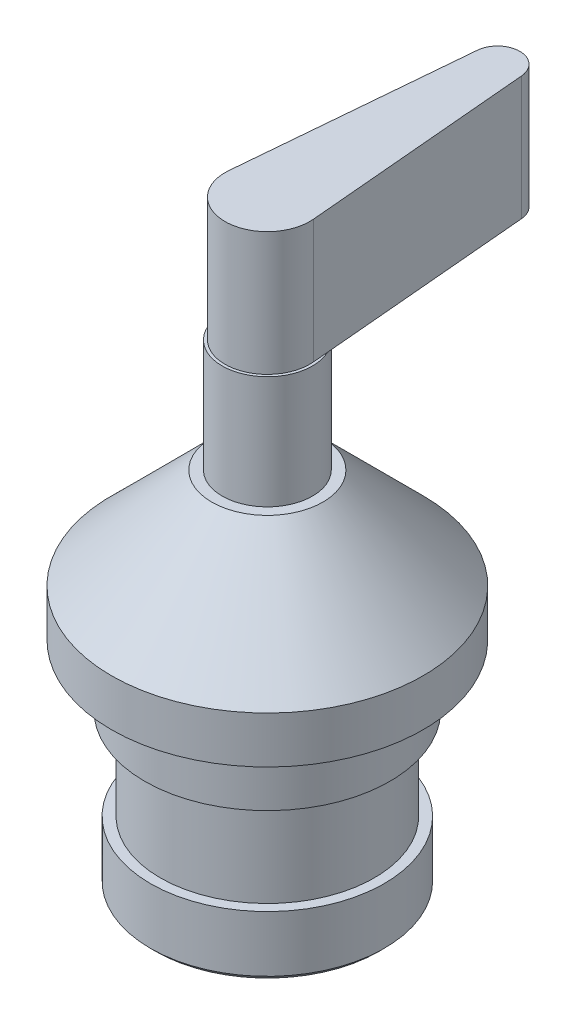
ISO-10303-21;
HEADER;
FILE_DESCRIPTION(('STEP AP214'),'2;1');
FILE_NAME('part.step','',(''),(''),'','','');
FILE_SCHEMA(('AUTOMOTIVE_DESIGN { 1 0 10303 214 1 1 1 1 }'));
ENDSEC;
DATA;
#1=APPLICATION_CONTEXT('core data for automotive mechanical design processes');
#2=APPLICATION_PROTOCOL_DEFINITION('international standard','automotive_design',2000,#1);
#3=PRODUCT_CONTEXT('',#1,'mechanical');
#4=PRODUCT('Part','Part','',(#3));
#5=PRODUCT_RELATED_PRODUCT_CATEGORY('part','',(#4));
#6=PRODUCT_DEFINITION_FORMATION('','',#4);
#7=PRODUCT_DEFINITION_CONTEXT('part definition',#1,'design');
#8=PRODUCT_DEFINITION('design','',#6,#7);
#9=PRODUCT_DEFINITION_SHAPE('','',#8);
#10=(LENGTH_UNIT() NAMED_UNIT(*) SI_UNIT(.MILLI.,.METRE.));
#11=(NAMED_UNIT(*) PLANE_ANGLE_UNIT() SI_UNIT($,.RADIAN.));
#12=(NAMED_UNIT(*) SI_UNIT($,.STERADIAN.) SOLID_ANGLE_UNIT());
#13=UNCERTAINTY_MEASURE_WITH_UNIT(LENGTH_MEASURE(1.E-05),#10,'distance_accuracy_value','');
#14=(GEOMETRIC_REPRESENTATION_CONTEXT(3) GLOBAL_UNCERTAINTY_ASSIGNED_CONTEXT((#13)) GLOBAL_UNIT_ASSIGNED_CONTEXT((#10,
#11,#12)) REPRESENTATION_CONTEXT('',''));
#15=CARTESIAN_POINT('',(0.,0.,0.));
#16=DIRECTION('',(0.,0.,1.));
#17=DIRECTION('',(1.,0.,0.));
#18=AXIS2_PLACEMENT_3D('',#15,#16,#17);
#19=CARTESIAN_POINT('',(11.049,63.5,0.));
#20=DIRECTION('',(0.,-1.,0.));
#21=DIRECTION('',(0.,0.,-1.));
#22=AXIS2_PLACEMENT_3D('',#19,#20,#21);
#23=PLANE('',#22);
#24=DIRECTION('',(-0.0873881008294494,0.,-0.996174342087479));
#25=VECTOR('',#24,1.);
#26=CARTESIAN_POINT('',(10.3183543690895,63.5,-0.905164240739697));
#27=LINE('',#26,#25);
#28=CARTESIAN_POINT('',(10.3183543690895,63.5,-0.905164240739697));
#29=VERTEX_POINT('',#28);
#30=CARTESIAN_POINT('',(9.98224921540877,63.5,-4.73657065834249));
#31=VERTEX_POINT('',#30);
#32=EDGE_CURVE('E53',#29,#31,#27,.T.);
#33=ORIENTED_EDGE('',*,*,#32,.F.);
#34=CARTESIAN_POINT('',(0.,63.5,0.));
#35=DIRECTION('',(0.,1.,0.));
#36=DIRECTION('',(0.,0.,1.));
#37=AXIS2_PLACEMENT_3D('',#34,#35,#36);
#38=CIRCLE('',#37,10.3579804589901);
#39=CARTESIAN_POINT('',(-10.3183543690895,63.5,-0.905164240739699));
#40=VERTEX_POINT('',#39);
#41=EDGE_CURVE('E91',#40,#29,#38,.T.);
#42=ORIENTED_EDGE('',*,*,#41,.F.);
#43=DIRECTION('',(-0.0873881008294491,0.,0.996174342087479));
#44=VECTOR('',#43,1.);
#45=CARTESIAN_POINT('',(-10.3183543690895,63.5,-0.905164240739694));
#46=LINE('',#45,#44);
#47=CARTESIAN_POINT('',(-9.98224921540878,63.5,-4.73657065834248));
#48=VERTEX_POINT('',#47);
#49=EDGE_CURVE('E11',#48,#40,#46,.T.);
#50=ORIENTED_EDGE('',*,*,#49,.F.);
#51=CARTESIAN_POINT('',(0.,63.5,0.));
#52=DIRECTION('',(0.,1.,0.));
#53=DIRECTION('',(0.,0.,1.));
#54=AXIS2_PLACEMENT_3D('',#51,#52,#53);
#55=CIRCLE('',#54,11.049);
#56=EDGE_CURVE('E139',#48,#31,#55,.T.);
#57=ORIENTED_EDGE('',*,*,#56,.T.);
#58=EDGE_LOOP('',(#33,#42,#50,#57));
#59=FACE_BOUND('',#58,.T.);
#60=ADVANCED_FACE('F36',(#59),#23,.F.);
#61=CARTESIAN_POINT('',(29.972,0.,0.));
#62=DIRECTION('',(0.,1.,0.));
#63=DIRECTION('',(0.,0.,1.));
#64=AXIS2_PLACEMENT_3D('',#61,#62,#63);
#65=PLANE('',#64);
#66=CARTESIAN_POINT('',(0.,0.,0.));
#67=DIRECTION('',(0.,1.,0.));
#68=DIRECTION('',(0.,0.,1.));
#69=AXIS2_PLACEMENT_3D('',#66,#67,#68);
#70=CIRCLE('',#69,38.1);
#71=CARTESIAN_POINT('',(0.,0.,38.1));
#72=VERTEX_POINT('',#71);
#73=EDGE_CURVE('E150',#72,#72,#70,.T.);
#74=ORIENTED_EDGE('',*,*,#73,.F.);
#75=EDGE_LOOP('',(#74));
#76=FACE_BOUND('',#75,.T.);
#77=CARTESIAN_POINT('',(0.,0.,0.));
#78=DIRECTION('',(0.,1.,0.));
#79=DIRECTION('',(0.,0.,1.));
#80=AXIS2_PLACEMENT_3D('',#77,#78,#79);
#81=CIRCLE('',#80,29.972);
#82=CARTESIAN_POINT('',(0.,0.,29.972));
#83=VERTEX_POINT('',#82);
#84=EDGE_CURVE('E100',#83,#83,#81,.T.);
#85=ORIENTED_EDGE('',*,*,#84,.T.);
#86=EDGE_LOOP('',(#85));
#87=FACE_BOUND('',#86,.T.);
#88=ADVANCED_FACE('F38',(#76,#87),#65,.F.);
#89=CARTESIAN_POINT('',(0.,76.3242929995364,0.));
#90=DIRECTION('',(0.,1.,0.));
#91=DIRECTION('',(0.,0.,1.));
#92=AXIS2_PLACEMENT_3D('',#89,#90,#91);
#93=CYLINDRICAL_SURFACE('',#92,38.1);
#94=CARTESIAN_POINT('',(0.,11.43,0.));
#95=DIRECTION('',(0.,1.,0.));
#96=DIRECTION('',(0.,0.,1.));
#97=AXIS2_PLACEMENT_3D('',#94,#95,#96);
#98=CIRCLE('',#97,38.1);
#99=CARTESIAN_POINT('',(0.,11.43,38.1));
#100=VERTEX_POINT('',#99);
#101=EDGE_CURVE('E147',#100,#100,#98,.T.);
#102=ORIENTED_EDGE('',*,*,#101,.F.);
#103=EDGE_LOOP('',(#102));
#104=FACE_BOUND('',#103,.T.);
#105=ORIENTED_EDGE('',*,*,#73,.T.);
#106=EDGE_LOOP('',(#105));
#107=FACE_BOUND('',#106,.T.);
#108=ADVANCED_FACE('F180',(#104,#107),#93,.T.);
#109=CARTESIAN_POINT('',(0.,11.43,0.));
#110=DIRECTION('',(0.,-1.,0.));
#111=DIRECTION('',(0.,0.,-1.));
#112=AXIS2_PLACEMENT_3D('',#109,#110,#111);
#113=CONICAL_SURFACE('',#112,38.1,0.78539816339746);
#114=CARTESIAN_POINT('',(0.,35.9409999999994,0.));
#115=DIRECTION('',(0.,1.,0.));
#116=DIRECTION('',(0.,0.,1.));
#117=AXIS2_PLACEMENT_3D('',#114,#115,#116);
#118=CIRCLE('',#117,13.589);
#119=CARTESIAN_POINT('',(0.,35.9409999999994,13.589));
#120=VERTEX_POINT('',#119);
#121=EDGE_CURVE('E144',#120,#120,#118,.T.);
#122=ORIENTED_EDGE('',*,*,#121,.F.);
#123=EDGE_LOOP('',(#122));
#124=FACE_BOUND('',#123,.T.);
#125=ORIENTED_EDGE('',*,*,#101,.T.);
#126=EDGE_LOOP('',(#125));
#127=FACE_BOUND('',#126,.T.);
#128=ADVANCED_FACE('F192',(#124,#127),#113,.T.);
#129=CARTESIAN_POINT('',(13.589,35.9409999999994,0.));
#130=DIRECTION('',(0.,-1.,0.));
#131=DIRECTION('',(0.,0.,-1.));
#132=AXIS2_PLACEMENT_3D('',#129,#130,#131);
#133=PLANE('',#132);
#134=CARTESIAN_POINT('',(0.,35.9409999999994,0.));
#135=DIRECTION('',(0.,1.,0.));
#136=DIRECTION('',(0.,0.,1.));
#137=AXIS2_PLACEMENT_3D('',#134,#135,#136);
#138=CIRCLE('',#137,11.049);
#139=CARTESIAN_POINT('',(0.,35.9409999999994,11.049));
#140=VERTEX_POINT('',#139);
#141=EDGE_CURVE('E141',#140,#140,#138,.T.);
#142=ORIENTED_EDGE('',*,*,#141,.F.);
#143=EDGE_LOOP('',(#142));
#144=FACE_BOUND('',#143,.T.);
#145=ORIENTED_EDGE('',*,*,#121,.T.);
#146=EDGE_LOOP('',(#145));
#147=FACE_BOUND('',#146,.T.);
#148=ADVANCED_FACE('F188',(#144,#147),#133,.F.);
#149=CARTESIAN_POINT('',(0.,76.3242929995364,0.));
#150=DIRECTION('',(0.,1.,0.));
#151=DIRECTION('',(0.,0.,1.));
#152=AXIS2_PLACEMENT_3D('',#149,#150,#151);
#153=CYLINDRICAL_SURFACE('',#152,11.049);
#154=EDGE_CURVE('E89',#31,#48,#55,.T.);
#155=ORIENTED_EDGE('',*,*,#154,.F.);
#156=ORIENTED_EDGE('',*,*,#56,.F.);
#157=EDGE_LOOP('',(#155,#156));
#158=FACE_BOUND('',#157,.T.);
#159=ORIENTED_EDGE('',*,*,#141,.T.);
#160=EDGE_LOOP('',(#159));
#161=FACE_BOUND('',#160,.T.);
#162=ADVANCED_FACE('F185',(#158,#161),#153,.T.);
#163=CARTESIAN_POINT('',(28.575,-52.324,0.));
#164=DIRECTION('',(0.,1.,0.));
#165=DIRECTION('',(0.,0.,1.));
#166=AXIS2_PLACEMENT_3D('',#163,#164,#165);
#167=PLANE('',#166);
#168=CARTESIAN_POINT('',(0.,-52.324,0.));
#169=DIRECTION('',(0.,1.,0.));
#170=DIRECTION('',(0.,0.,1.));
#171=AXIS2_PLACEMENT_3D('',#168,#169,#170);
#172=CIRCLE('',#171,27.305);
#173=CARTESIAN_POINT('',(0.,-52.324,27.305));
#174=VERTEX_POINT('',#173);
#175=EDGE_CURVE('E40',#174,#174,#172,.F.);
#176=ORIENTED_EDGE('',*,*,#175,.T.);
#177=EDGE_LOOP('',(#176));
#178=FACE_BOUND('',#177,.T.);
#179=ADVANCED_FACE('F159',(#178),#167,.F.);
#180=CARTESIAN_POINT('',(0.,76.3242929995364,0.));
#181=DIRECTION('',(0.,1.,0.));
#182=DIRECTION('',(0.,0.,1.));
#183=AXIS2_PLACEMENT_3D('',#180,#181,#182);
#184=CYLINDRICAL_SURFACE('',#183,28.575);
#185=CARTESIAN_POINT('',(0.,-51.054,0.));
#186=DIRECTION('',(0.,1.,0.));
#187=DIRECTION('',(0.,0.,1.));
#188=AXIS2_PLACEMENT_3D('',#185,#186,#187);
#189=CIRCLE('',#188,28.575);
#190=CARTESIAN_POINT('',(0.,-51.054,28.575));
#191=VERTEX_POINT('',#190);
#192=EDGE_CURVE('E152',#191,#191,#189,.T.);
#193=ORIENTED_EDGE('',*,*,#192,.T.);
#194=EDGE_LOOP('',(#193));
#195=FACE_BOUND('',#194,.T.);
#196=CARTESIAN_POINT('',(0.,-37.338,0.));
#197=DIRECTION('',(0.,1.,0.));
#198=DIRECTION('',(0.,0.,1.));
#199=AXIS2_PLACEMENT_3D('',#196,#197,#198);
#200=CIRCLE('',#199,28.575);
#201=CARTESIAN_POINT('',(0.,-37.338,28.575));
#202=VERTEX_POINT('',#201);
#203=EDGE_CURVE('E136',#202,#202,#200,.T.);
#204=ORIENTED_EDGE('',*,*,#203,.F.);
#205=EDGE_LOOP('',(#204));
#206=FACE_BOUND('',#205,.T.);
#207=ADVANCED_FACE('F222',(#195,#206),#184,.T.);
#208=CARTESIAN_POINT('',(26.162,-37.338,0.));
#209=DIRECTION('',(0.,-1.,0.));
#210=DIRECTION('',(0.,0.,-1.));
#211=AXIS2_PLACEMENT_3D('',#208,#209,#210);
#212=PLANE('',#211);
#213=CARTESIAN_POINT('',(0.,-37.338,0.));
#214=DIRECTION('',(0.,1.,0.));
#215=DIRECTION('',(0.,0.,1.));
#216=AXIS2_PLACEMENT_3D('',#213,#214,#215);
#217=CIRCLE('',#216,26.162);
#218=CARTESIAN_POINT('',(0.,-37.338,26.162));
#219=VERTEX_POINT('',#218);
#220=EDGE_CURVE('E133',#219,#219,#217,.T.);
#221=ORIENTED_EDGE('',*,*,#220,.F.);
#222=EDGE_LOOP('',(#221));
#223=FACE_BOUND('',#222,.T.);
#224=ORIENTED_EDGE('',*,*,#203,.T.);
#225=EDGE_LOOP('',(#224));
#226=FACE_BOUND('',#225,.T.);
#227=ADVANCED_FACE('F216',(#223,#226),#212,.F.);
#228=CARTESIAN_POINT('',(0.,76.3242929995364,0.));
#229=DIRECTION('',(0.,1.,0.));
#230=DIRECTION('',(0.,0.,1.));
#231=AXIS2_PLACEMENT_3D('',#228,#229,#230);
#232=CYLINDRICAL_SURFACE('',#231,26.162);
#233=CARTESIAN_POINT('',(0.,-14.986,0.));
#234=DIRECTION('',(0.,1.,0.));
#235=DIRECTION('',(0.,0.,1.));
#236=AXIS2_PLACEMENT_3D('',#233,#234,#235);
#237=CIRCLE('',#236,26.162);
#238=CARTESIAN_POINT('',(0.,-14.986,26.162));
#239=VERTEX_POINT('',#238);
#240=EDGE_CURVE('E130',#239,#239,#237,.T.);
#241=ORIENTED_EDGE('',*,*,#240,.F.);
#242=EDGE_LOOP('',(#241));
#243=FACE_BOUND('',#242,.T.);
#244=ORIENTED_EDGE('',*,*,#220,.T.);
#245=EDGE_LOOP('',(#244));
#246=FACE_BOUND('',#245,.T.);
#247=ADVANCED_FACE('F210',(#243,#246),#232,.T.);
#248=CARTESIAN_POINT('',(26.162,-14.986,0.));
#249=DIRECTION('',(0.,1.,0.));
#250=DIRECTION('',(0.,0.,1.));
#251=AXIS2_PLACEMENT_3D('',#248,#249,#250);
#252=PLANE('',#251);
#253=CARTESIAN_POINT('',(0.,-14.986,0.));
#254=DIRECTION('',(0.,1.,0.));
#255=DIRECTION('',(0.,0.,1.));
#256=AXIS2_PLACEMENT_3D('',#253,#254,#255);
#257=CIRCLE('',#256,29.972);
#258=CARTESIAN_POINT('',(0.,-14.986,29.972));
#259=VERTEX_POINT('',#258);
#260=EDGE_CURVE('E127',#259,#259,#257,.T.);
#261=ORIENTED_EDGE('',*,*,#260,.F.);
#262=EDGE_LOOP('',(#261));
#263=FACE_BOUND('',#262,.T.);
#264=ORIENTED_EDGE('',*,*,#240,.T.);
#265=EDGE_LOOP('',(#264));
#266=FACE_BOUND('',#265,.T.);
#267=ADVANCED_FACE('F171',(#263,#266),#252,.F.);
#268=CARTESIAN_POINT('',(0.,76.3242929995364,0.));
#269=DIRECTION('',(0.,1.,0.));
#270=DIRECTION('',(0.,0.,1.));
#271=AXIS2_PLACEMENT_3D('',#268,#269,#270);
#272=CYLINDRICAL_SURFACE('',#271,29.972);
#273=ORIENTED_EDGE('',*,*,#84,.F.);
#274=EDGE_LOOP('',(#273));
#275=FACE_BOUND('',#274,.T.);
#276=ORIENTED_EDGE('',*,*,#260,.T.);
#277=EDGE_LOOP('',(#276));
#278=FACE_BOUND('',#277,.T.);
#279=ADVANCED_FACE('F164',(#275,#278),#272,.T.);
#280=CARTESIAN_POINT('',(0.,-51.054,0.));
#281=DIRECTION('',(0.,1.,0.));
#282=DIRECTION('',(0.,0.,1.));
#283=AXIS2_PLACEMENT_3D('',#280,#281,#282);
#284=CONICAL_SURFACE('',#283,28.575,0.785398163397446);
#285=ORIENTED_EDGE('',*,*,#175,.F.);
#286=EDGE_LOOP('',(#285));
#287=FACE_BOUND('',#286,.T.);
#288=ORIENTED_EDGE('',*,*,#192,.F.);
#289=EDGE_LOOP('',(#288));
#290=FACE_BOUND('',#289,.T.);
#291=ADVANCED_FACE('F161',(#287,#290),#284,.T.);
#292=CARTESIAN_POINT('',(0.,63.5,-56.282434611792));
#293=DIRECTION('',(0.,1.,0.));
#294=DIRECTION('',(0.,0.,1.));
#295=AXIS2_PLACEMENT_3D('',#292,#293,#294);
#296=PLANE('',#295);
#297=CARTESIAN_POINT('',(5.41875547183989,63.5,-56.7577879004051));
#298=VERTEX_POINT('',#297);
#299=EDGE_CURVE('E110',#31,#298,#27,.T.);
#300=ORIENTED_EDGE('',*,*,#299,.F.);
#301=ORIENTED_EDGE('',*,*,#154,.T.);
#302=CARTESIAN_POINT('',(-5.41875547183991,63.5,-56.7577879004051));
#303=VERTEX_POINT('',#302);
#304=EDGE_CURVE('E46',#303,#48,#46,.T.);
#305=ORIENTED_EDGE('',*,*,#304,.F.);
#306=CARTESIAN_POINT('',(0.,63.5,-56.282434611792));
#307=DIRECTION('',(0.,1.,0.));
#308=DIRECTION('',(0.,0.,1.));
#309=AXIS2_PLACEMENT_3D('',#306,#307,#308);
#310=CIRCLE('',#309,5.43956538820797);
#311=EDGE_CURVE('E87',#298,#303,#310,.T.);
#312=ORIENTED_EDGE('',*,*,#311,.F.);
#313=EDGE_LOOP('',(#300,#301,#305,#312));
#314=FACE_BOUND('',#313,.T.);
#315=ADVANCED_FACE('F85',(#314),#296,.F.);
#316=CARTESIAN_POINT('',(0.,93.726,-56.282434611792));
#317=DIRECTION('',(0.,-1.,0.));
#318=DIRECTION('',(0.,0.,-1.));
#319=AXIS2_PLACEMENT_3D('',#316,#317,#318);
#320=CYLINDRICAL_SURFACE('',#319,5.43956538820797);
#321=ORIENTED_EDGE('',*,*,#311,.T.);
#322=DIRECTION('',(0.,-1.,0.));
#323=VECTOR('',#322,1.);
#324=CARTESIAN_POINT('',(-5.41875547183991,93.726,-56.7577879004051));
#325=LINE('',#324,#323);
#326=CARTESIAN_POINT('',(-5.41875547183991,93.726,-56.7577879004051));
#327=VERTEX_POINT('',#326);
#328=EDGE_CURVE('E93',#327,#303,#325,.T.);
#329=ORIENTED_EDGE('',*,*,#328,.F.);
#330=CARTESIAN_POINT('',(0.,93.726,-56.282434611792));
#331=DIRECTION('',(0.,1.,0.));
#332=DIRECTION('',(0.,0.,1.));
#333=AXIS2_PLACEMENT_3D('',#330,#331,#332);
#334=CIRCLE('',#333,5.43956538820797);
#335=CARTESIAN_POINT('',(5.41875547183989,93.726,-56.7577879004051));
#336=VERTEX_POINT('',#335);
#337=EDGE_CURVE('E112',#336,#327,#334,.T.);
#338=ORIENTED_EDGE('',*,*,#337,.F.);
#339=DIRECTION('',(0.,-1.,0.));
#340=VECTOR('',#339,1.);
#341=CARTESIAN_POINT('',(5.41875547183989,93.726,-56.7577879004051));
#342=LINE('',#341,#340);
#343=EDGE_CURVE('E106',#336,#298,#342,.T.);
#344=ORIENTED_EDGE('',*,*,#343,.T.);
#345=EDGE_LOOP('',(#321,#329,#338,#344));
#346=FACE_BOUND('',#345,.T.);
#347=ADVANCED_FACE('F104',(#346),#320,.T.);
#348=CARTESIAN_POINT('',(-10.3183543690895,93.726,-0.905164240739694));
#349=DIRECTION('',(0.996174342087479,0.,0.0873881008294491));
#350=DIRECTION('',(0.0873881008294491,0.,-0.996174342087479));
#351=AXIS2_PLACEMENT_3D('',#348,#349,#350);
#352=PLANE('',#351);
#353=ORIENTED_EDGE('',*,*,#304,.T.);
#354=ORIENTED_EDGE('',*,*,#49,.T.);
#355=DIRECTION('',(0.,-1.,0.));
#356=VECTOR('',#355,1.);
#357=CARTESIAN_POINT('',(-10.3183543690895,93.726,-0.905164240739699));
#358=LINE('',#357,#356);
#359=CARTESIAN_POINT('',(-10.3183543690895,93.726,-0.905164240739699));
#360=VERTEX_POINT('',#359);
#361=EDGE_CURVE('E101',#360,#40,#358,.T.);
#362=ORIENTED_EDGE('',*,*,#361,.F.);
#363=DIRECTION('',(-0.0873881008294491,0.,0.996174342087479));
#364=VECTOR('',#363,1.);
#365=CARTESIAN_POINT('',(-10.3183543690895,93.726,-0.905164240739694));
#366=LINE('',#365,#364);
#367=EDGE_CURVE('E96',#327,#360,#366,.T.);
#368=ORIENTED_EDGE('',*,*,#367,.F.);
#369=ORIENTED_EDGE('',*,*,#328,.T.);
#370=EDGE_LOOP('',(#353,#354,#362,#368,#369));
#371=FACE_BOUND('',#370,.T.);
#372=ADVANCED_FACE('F94',(#371),#352,.F.);
#373=CARTESIAN_POINT('',(0.,93.726,0.));
#374=DIRECTION('',(0.,-1.,0.));
#375=DIRECTION('',(0.,0.,-1.));
#376=AXIS2_PLACEMENT_3D('',#373,#374,#375);
#377=CYLINDRICAL_SURFACE('',#376,10.3579804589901);
#378=ORIENTED_EDGE('',*,*,#41,.T.);
#379=DIRECTION('',(0.,-1.,0.));
#380=VECTOR('',#379,1.);
#381=CARTESIAN_POINT('',(10.3183543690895,93.726,-0.905164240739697));
#382=LINE('',#381,#380);
#383=CARTESIAN_POINT('',(10.3183543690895,93.726,-0.905164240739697));
#384=VERTEX_POINT('',#383);
#385=EDGE_CURVE('E120',#384,#29,#382,.T.);
#386=ORIENTED_EDGE('',*,*,#385,.F.);
#387=CARTESIAN_POINT('',(0.,93.726,0.));
#388=DIRECTION('',(0.,1.,0.));
#389=DIRECTION('',(0.,0.,1.));
#390=AXIS2_PLACEMENT_3D('',#387,#388,#389);
#391=CIRCLE('',#390,10.3579804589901);
#392=EDGE_CURVE('E115',#360,#384,#391,.T.);
#393=ORIENTED_EDGE('',*,*,#392,.F.);
#394=ORIENTED_EDGE('',*,*,#361,.T.);
#395=EDGE_LOOP('',(#378,#386,#393,#394));
#396=FACE_BOUND('',#395,.T.);
#397=ADVANCED_FACE('F313',(#396),#377,.T.);
#398=CARTESIAN_POINT('',(10.3183543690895,93.726,-0.905164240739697));
#399=DIRECTION('',(-0.996174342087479,0.,0.0873881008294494));
#400=DIRECTION('',(0.0873881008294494,0.,0.996174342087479));
#401=AXIS2_PLACEMENT_3D('',#398,#399,#400);
#402=PLANE('',#401);
#403=ORIENTED_EDGE('',*,*,#32,.T.);
#404=ORIENTED_EDGE('',*,*,#299,.T.);
#405=ORIENTED_EDGE('',*,*,#343,.F.);
#406=DIRECTION('',(-0.0873881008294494,0.,-0.996174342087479));
#407=VECTOR('',#406,1.);
#408=CARTESIAN_POINT('',(10.3183543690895,93.726,-0.905164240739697));
#409=LINE('',#408,#407);
#410=EDGE_CURVE('E117',#384,#336,#409,.T.);
#411=ORIENTED_EDGE('',*,*,#410,.F.);
#412=ORIENTED_EDGE('',*,*,#385,.T.);
#413=EDGE_LOOP('',(#403,#404,#405,#411,#412));
#414=FACE_BOUND('',#413,.T.);
#415=ADVANCED_FACE('F321',(#414),#402,.F.);
#416=CARTESIAN_POINT('',(0.,93.726,-56.282434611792));
#417=DIRECTION('',(0.,1.,0.));
#418=DIRECTION('',(0.,0.,1.));
#419=AXIS2_PLACEMENT_3D('',#416,#417,#418);
#420=PLANE('',#419);
#421=ORIENTED_EDGE('',*,*,#337,.T.);
#422=ORIENTED_EDGE('',*,*,#367,.T.);
#423=ORIENTED_EDGE('',*,*,#392,.T.);
#424=ORIENTED_EDGE('',*,*,#410,.T.);
#425=EDGE_LOOP('',(#421,#422,#423,#424));
#426=FACE_BOUND('',#425,.T.);
#427=ADVANCED_FACE('F330',(#426),#420,.T.);
#428=CLOSED_SHELL('',(#60,#88,#108,#128,#148,#162,#179,#207,#227,#247,#267,#279,#291,#315,#347,
#372,#397,#415,#427));
#429=MANIFOLD_SOLID_BREP('B2',#428);
#430=ADVANCED_BREP_SHAPE_REPRESENTATION('',(#18,#429),#14);
#431=SHAPE_DEFINITION_REPRESENTATION(#9,#430);
ENDSEC;
END-ISO-10303-21;
